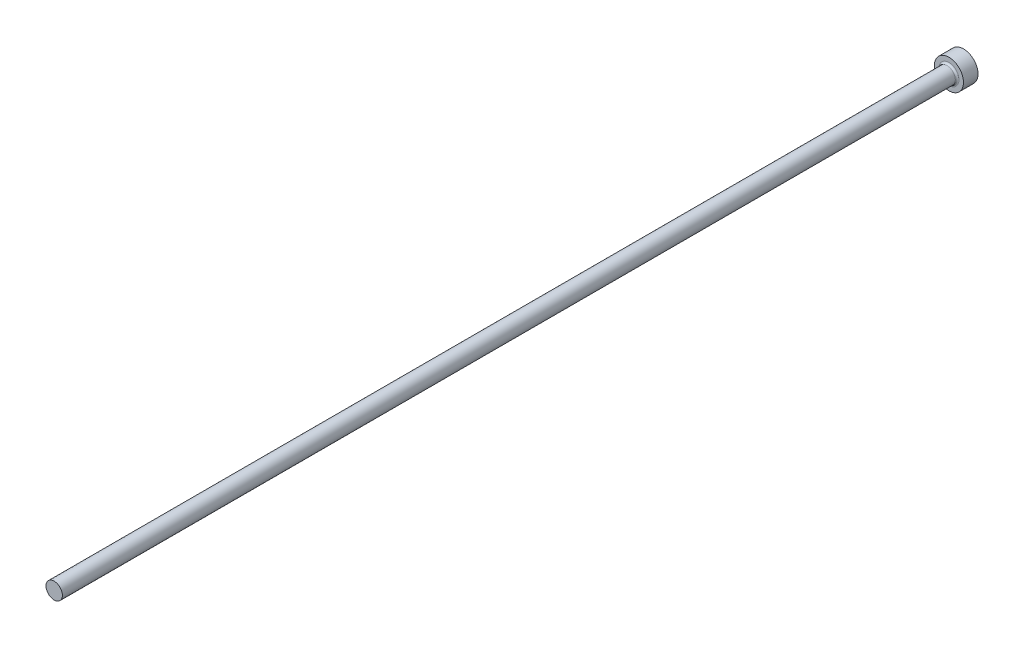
from build123d import *

# Parameters (mm, degrees)
FILLET1_R = 0.5


with BuildPart() as part:
    # FV → Revolve1 (revolve)
    with BuildSketch(Plane(origin=(0, 0, 0), x_dir=(1, 0, 0), z_dir=(0, 1, 0)), mode=Mode.PRIVATE) as revolve1_sk:
        Polygon((0, 0), (4, 0), (4, -4), (2.25, -4), (2.25, -250), (0, -250), align=None)
    revolve(revolve1_sk.sketch.rotate(Axis((0, 0, -9.033228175), (0, 0, 1)), 180), axis=Axis((0, 0, -9.033228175), (0, 0, 1)))

    # Fillet1
    fillet1_edges = [part.edges().sort_by_distance(p)[0] for p in [
        (2.25, 0, 4),
    ]]
    fillet(fillet1_edges, radius=FILLET1_R)


solid = part.part
